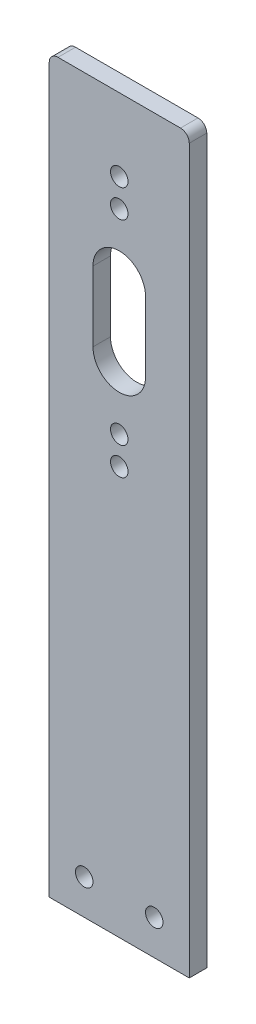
from build123d import *

# Parameters (mm, degrees)
SKETCH1_W      = 50.8
SKETCH1_H      = 265.43
SKETCH1_R      = 3.175
EXTRUDE1_DEPTH = 3.175
FILLET1_R      = 3.175


with BuildPart() as part:
    # Sketch1 → Extrude1 (new, symmetric)
    with BuildSketch(Plane.XY):
        Rectangle(SKETCH1_W, SKETCH1_H)
        with Locations((0, 106.35742)):
            Circle(SKETCH1_R, mode=Mode.SUBTRACT)
        with Locations((0, 96.19742)):
            Circle(SKETCH1_R, mode=Mode.SUBTRACT)
        with Locations((0, 15.24)):
            Circle(SKETCH1_R, mode=Mode.SUBTRACT)
        with Locations((0, 25.4)):
            Circle(SKETCH1_R, mode=Mode.SUBTRACT)
        with Locations((12.7, -120.015)):
            Circle(SKETCH1_R, mode=Mode.SUBTRACT)
        with Locations((-12.7, -120.015)):
            Circle(SKETCH1_R, mode=Mode.SUBTRACT)
        with BuildLine():
            Line((9.525, 73.49871), (9.525, 48.09871))
            ThreePointArc((9.525, 48.09871), (0, 38.57371), (-9.525, 48.09871))
            Line((-9.525, 48.09871), (-9.525, 73.49871))
            ThreePointArc((-9.525, 73.49871), (0, 83.02371), (9.525, 73.49871))
        make_face(mode=Mode.SUBTRACT)
    extrude(amount=EXTRUDE1_DEPTH, both=True)

    # Fillet1
    fillet1_edges = [part.edges().sort_by_distance(p)[0] for p in [
        (-25.4, 132.715, 0),
        (25.4, 132.715, 0),
    ]]
    fillet(fillet1_edges, radius=FILLET1_R)


solid = part.part
